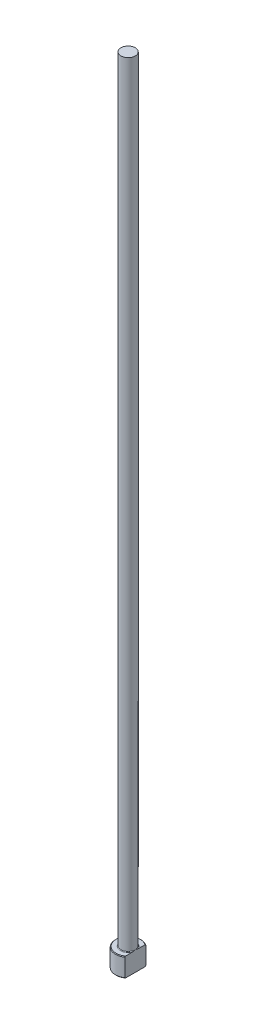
ISO-10303-21;
HEADER;
FILE_DESCRIPTION(('STEP AP214'),'2;1');
FILE_NAME('part.step','',(''),(''),'','','');
FILE_SCHEMA(('AUTOMOTIVE_DESIGN { 1 0 10303 214 1 1 1 1 }'));
ENDSEC;
DATA;
#1=APPLICATION_CONTEXT('core data for automotive mechanical design processes');
#2=APPLICATION_PROTOCOL_DEFINITION('international standard','automotive_design',2000,#1);
#3=PRODUCT_CONTEXT('',#1,'mechanical');
#4=PRODUCT('Part','Part','',(#3));
#5=PRODUCT_RELATED_PRODUCT_CATEGORY('part','',(#4));
#6=PRODUCT_DEFINITION_FORMATION('','',#4);
#7=PRODUCT_DEFINITION_CONTEXT('part definition',#1,'design');
#8=PRODUCT_DEFINITION('design','',#6,#7);
#9=PRODUCT_DEFINITION_SHAPE('','',#8);
#10=(LENGTH_UNIT() NAMED_UNIT(*) SI_UNIT(.MILLI.,.METRE.));
#11=(NAMED_UNIT(*) PLANE_ANGLE_UNIT() SI_UNIT($,.RADIAN.));
#12=(NAMED_UNIT(*) SI_UNIT($,.STERADIAN.) SOLID_ANGLE_UNIT());
#13=UNCERTAINTY_MEASURE_WITH_UNIT(LENGTH_MEASURE(1.E-05),#10,'distance_accuracy_value','');
#14=(GEOMETRIC_REPRESENTATION_CONTEXT(3) GLOBAL_UNCERTAINTY_ASSIGNED_CONTEXT((#13)) GLOBAL_UNIT_ASSIGNED_CONTEXT((#10,
#11,#12)) REPRESENTATION_CONTEXT('',''));
#15=CARTESIAN_POINT('',(0.,0.,0.));
#16=DIRECTION('',(0.,0.,1.));
#17=DIRECTION('',(1.,0.,0.));
#18=AXIS2_PLACEMENT_3D('',#15,#16,#17);
#19=CARTESIAN_POINT('',(0.,0.,0.));
#20=DIRECTION('',(0.,-1.,0.));
#21=DIRECTION('',(0.,0.,-1.));
#22=AXIS2_PLACEMENT_3D('',#19,#20,#21);
#23=PLANE('',#22);
#24=CARTESIAN_POINT('',(0.,0.,0.));
#25=DIRECTION('',(0.,-1.,0.));
#26=DIRECTION('',(0.,0.,-1.));
#27=AXIS2_PLACEMENT_3D('',#24,#25,#26);
#28=CIRCLE('',#27,3.79999999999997);
#29=CARTESIAN_POINT('',(2.24999999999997,0.,3.0622703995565));
#30=VERTEX_POINT('',#29);
#31=CARTESIAN_POINT('',(2.24999999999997,0.,-3.0622703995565));
#32=VERTEX_POINT('',#31);
#33=EDGE_CURVE('E98',#30,#32,#28,.T.);
#34=ORIENTED_EDGE('',*,*,#33,.T.);
#35=DIRECTION('',(0.,0.,1.));
#36=VECTOR('',#35,1.);
#37=CARTESIAN_POINT('',(2.24999999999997,0.,3.30718913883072));
#38=LINE('',#37,#36);
#39=EDGE_CURVE('E83',#32,#30,#38,.T.);
#40=ORIENTED_EDGE('',*,*,#39,.T.);
#41=EDGE_LOOP('',(#34,#40));
#42=FACE_BOUND('',#41,.T.);
#43=ADVANCED_FACE('F32',(#42),#23,.T.);
#44=CARTESIAN_POINT('',(0.,259.958771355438,0.));
#45=DIRECTION('',(0.,1.,0.));
#46=DIRECTION('',(0.,0.,1.));
#47=AXIS2_PLACEMENT_3D('',#44,#45,#46);
#48=CYLINDRICAL_SURFACE('',#47,3.99999999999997);
#49=CARTESIAN_POINT('',(0.,5.79999999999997,0.));
#50=DIRECTION('',(0.,1.,0.));
#51=DIRECTION('',(0.,0.,1.));
#52=AXIS2_PLACEMENT_3D('',#49,#50,#51);
#53=CIRCLE('',#52,3.99999999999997);
#54=CARTESIAN_POINT('',(2.24999999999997,5.79999999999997,3.30718913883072));
#55=VERTEX_POINT('',#54);
#56=CARTESIAN_POINT('',(2.24999999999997,5.79999999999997,-3.30718913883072));
#57=VERTEX_POINT('',#56);
#58=EDGE_CURVE('E104',#55,#57,#53,.F.);
#59=ORIENTED_EDGE('',*,*,#58,.T.);
#60=DIRECTION('',(0.,-1.,0.));
#61=VECTOR('',#60,1.);
#62=CARTESIAN_POINT('',(2.24999999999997,250.,-3.30718913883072));
#63=LINE('',#62,#61);
#64=CARTESIAN_POINT('',(2.24999999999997,0.200000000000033,-3.30718913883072));
#65=VERTEX_POINT('',#64);
#66=EDGE_CURVE('E183',#57,#65,#63,.T.);
#67=ORIENTED_EDGE('',*,*,#66,.T.);
#68=CARTESIAN_POINT('',(0.,0.200000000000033,0.));
#69=DIRECTION('',(0.,-1.,0.));
#70=DIRECTION('',(0.,0.,-1.));
#71=AXIS2_PLACEMENT_3D('',#68,#69,#70);
#72=CIRCLE('',#71,3.99999999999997);
#73=CARTESIAN_POINT('',(2.24999999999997,0.200000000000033,3.30718913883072));
#74=VERTEX_POINT('',#73);
#75=EDGE_CURVE('E100',#65,#74,#72,.F.);
#76=ORIENTED_EDGE('',*,*,#75,.T.);
#77=DIRECTION('',(0.,-1.,0.));
#78=VECTOR('',#77,1.);
#79=CARTESIAN_POINT('',(2.24999999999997,250.,3.30718913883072));
#80=LINE('',#79,#78);
#81=EDGE_CURVE('E93',#55,#74,#80,.T.);
#82=ORIENTED_EDGE('',*,*,#81,.F.);
#83=EDGE_LOOP('',(#59,#67,#76,#82));
#84=FACE_BOUND('',#83,.T.);
#85=ADVANCED_FACE('F158',(#84),#48,.T.);
#86=CARTESIAN_POINT('',(-3.99999999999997,6.,0.));
#87=DIRECTION('',(0.,1.,0.));
#88=DIRECTION('',(0.,0.,1.));
#89=AXIS2_PLACEMENT_3D('',#86,#87,#88);
#90=PLANE('',#89);
#91=CARTESIAN_POINT('',(0.,6.,0.));
#92=DIRECTION('',(0.,1.,0.));
#93=DIRECTION('',(0.,0.,1.));
#94=AXIS2_PLACEMENT_3D('',#91,#92,#93);
#95=CIRCLE('',#94,3.79999999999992);
#96=CARTESIAN_POINT('',(2.24999999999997,6.,-3.06227039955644));
#97=VERTEX_POINT('',#96);
#98=CARTESIAN_POINT('',(2.24999999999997,6.,3.06227039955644));
#99=VERTEX_POINT('',#98);
#100=EDGE_CURVE('E178',#97,#99,#95,.T.);
#101=ORIENTED_EDGE('',*,*,#100,.T.);
#102=DIRECTION('',(0.,0.,-1.));
#103=VECTOR('',#102,1.);
#104=CARTESIAN_POINT('',(2.24999999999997,6.,0.));
#105=LINE('',#104,#103);
#106=CARTESIAN_POINT('',(2.24999999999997,5.99999999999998,0.96953597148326));
#107=VERTEX_POINT('',#106);
#108=EDGE_CURVE('E57',#99,#107,#105,.T.);
#109=ORIENTED_EDGE('',*,*,#108,.T.);
#110=CARTESIAN_POINT('',(0.,6.,0.));
#111=DIRECTION('',(0.,1.,0.));
#112=DIRECTION('',(0.,0.,1.));
#113=AXIS2_PLACEMENT_3D('',#110,#111,#112);
#114=CIRCLE('',#113,2.44999999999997);
#115=CARTESIAN_POINT('',(2.24999999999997,5.99999999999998,-0.969535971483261));
#116=VERTEX_POINT('',#115);
#117=EDGE_CURVE('E107',#107,#116,#114,.F.);
#118=ORIENTED_EDGE('',*,*,#117,.T.);
#119=EDGE_CURVE('E136',#116,#97,#105,.T.);
#120=ORIENTED_EDGE('',*,*,#119,.T.);
#121=EDGE_LOOP('',(#101,#109,#118,#120));
#122=FACE_BOUND('',#121,.T.);
#123=ADVANCED_FACE('F147',(#122),#90,.T.);
#124=CARTESIAN_POINT('',(0.,6.00000000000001,0.));
#125=DIRECTION('',(0.,-1.,0.));
#126=DIRECTION('',(0.,0.,-1.));
#127=AXIS2_PLACEMENT_3D('',#124,#125,#126);
#128=CONICAL_SURFACE('',#127,3.79999999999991,0.785398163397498);
#129=ORIENTED_EDGE('',*,*,#58,.F.);
#130=CARTESIAN_POINT('',(2.24999999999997,2.18230294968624,7.27782992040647));
#131=CARTESIAN_POINT('',(2.24999999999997,2.30866715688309,7.14556140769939));
#132=CARTESIAN_POINT('',(2.24999999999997,2.43487774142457,7.0131459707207));
#133=CARTESIAN_POINT('',(2.24999999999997,2.68692885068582,6.74796170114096));
#134=CARTESIAN_POINT('',(2.24999999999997,2.8127693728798,6.6151928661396));
#135=CARTESIAN_POINT('',(2.24999999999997,3.1897057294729,6.21619905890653));
#136=CARTESIAN_POINT('',(2.24999999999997,3.44014920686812,5.94935693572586));
#137=CARTESIAN_POINT('',(2.24999999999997,3.94026066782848,5.4114698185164));
#138=CARTESIAN_POINT('',(2.24999999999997,4.18991116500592,5.14040850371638));
#139=CARTESIAN_POINT('',(2.24999999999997,4.56140055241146,4.73113683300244));
#140=CARTESIAN_POINT('',(2.24999999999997,4.68472451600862,4.59427552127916));
#141=CARTESIAN_POINT('',(2.24999999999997,4.93009407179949,4.31941326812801));
#142=CARTESIAN_POINT('',(2.24999999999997,5.05213967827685,4.18141233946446));
#143=CARTESIAN_POINT('',(2.24999999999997,5.31419582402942,3.88150807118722));
#144=CARTESIAN_POINT('',(2.24999999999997,5.45391708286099,3.71935099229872));
#145=CARTESIAN_POINT('',(2.24999999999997,5.73025215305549,3.39234412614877));
#146=CARTESIAN_POINT('',(2.24999999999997,5.86686529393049,3.22749377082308));
#147=CARTESIAN_POINT('',(2.24999999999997,6.13534139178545,2.89430849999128));
#148=CARTESIAN_POINT('',(2.24999999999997,6.26721073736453,2.72597879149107));
#149=CARTESIAN_POINT('',(2.24999999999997,6.45966785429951,2.46950762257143));
#150=CARTESIAN_POINT('',(2.24999999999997,6.52291962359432,2.38336821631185));
#151=CARTESIAN_POINT('',(2.24999999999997,6.64714184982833,2.20946418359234));
#152=CARTESIAN_POINT('',(2.24999999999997,6.70811252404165,2.12169971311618));
#153=CARTESIAN_POINT('',(2.24999999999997,6.82102230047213,1.95327886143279));
#154=CARTESIAN_POINT('',(2.24999999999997,6.87324695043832,1.87281476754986));
#155=CARTESIAN_POINT('',(2.24999999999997,6.97467249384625,1.70998172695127));
#156=CARTESIAN_POINT('',(2.24999999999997,7.02387305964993,1.62761257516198));
#157=CARTESIAN_POINT('',(2.24999999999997,7.11837607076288,1.46059799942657));
#158=CARTESIAN_POINT('',(2.24999999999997,7.16367708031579,1.37595175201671));
#159=CARTESIAN_POINT('',(2.24999999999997,7.24914050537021,1.20413766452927));
#160=CARTESIAN_POINT('',(2.24999999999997,7.28930406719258,1.11697039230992));
#161=CARTESIAN_POINT('',(2.24999999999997,7.38314726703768,0.891175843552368));
#162=CARTESIAN_POINT('',(2.24999999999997,7.43219749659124,0.750488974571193));
#163=CARTESIAN_POINT('',(2.24999999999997,7.48826674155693,0.535159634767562));
#164=CARTESIAN_POINT('',(2.24999999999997,7.50402844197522,0.462776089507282));
#165=CARTESIAN_POINT('',(2.24999999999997,7.52893388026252,0.31686046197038));
#166=CARTESIAN_POINT('',(2.24999999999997,7.53807847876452,0.24332853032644));
#167=CARTESIAN_POINT('',(2.24999999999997,7.54922474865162,0.0949504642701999));
#168=CARTESIAN_POINT('',(2.24999999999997,7.5511515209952,0.0200986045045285));
#169=CARTESIAN_POINT('',(2.24999999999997,7.54752076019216,-0.129420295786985));
#170=CARTESIAN_POINT('',(2.24999999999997,7.54196316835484,-0.204087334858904));
#171=CARTESIAN_POINT('',(2.24999999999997,7.52372329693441,-0.35268844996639));
#172=CARTESIAN_POINT('',(2.24999999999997,7.51102617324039,-0.426620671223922));
#173=CARTESIAN_POINT('',(2.24999999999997,7.47926333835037,-0.573094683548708));
#174=CARTESIAN_POINT('',(2.24999999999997,7.46019612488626,-0.645636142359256));
#175=CARTESIAN_POINT('',(2.24999999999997,7.40610994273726,-0.823701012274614));
#176=CARTESIAN_POINT('',(2.24999999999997,7.36783449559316,-0.928230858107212));
#177=CARTESIAN_POINT('',(2.24999999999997,7.28232692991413,-1.1335407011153));
#178=CARTESIAN_POINT('',(2.24999999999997,7.23508812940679,-1.23431783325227));
#179=CARTESIAN_POINT('',(2.24999999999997,7.13380125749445,-1.43298762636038));
#180=CARTESIAN_POINT('',(2.24999999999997,7.0797202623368,-1.53086330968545));
#181=CARTESIAN_POINT('',(2.24999999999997,6.99496203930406,-1.6754864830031));
#182=CARTESIAN_POINT('',(2.24999999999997,6.9661081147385,-1.72332162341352));
#183=CARTESIAN_POINT('',(2.24999999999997,6.90734436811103,-1.81833709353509));
#184=CARTESIAN_POINT('',(2.24999999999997,6.87743458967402,-1.86551745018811));
#185=CARTESIAN_POINT('',(2.24999999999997,6.77509597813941,-2.0235462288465));
#186=CARTESIAN_POINT('',(2.24999999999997,6.70057106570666,-2.13303820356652));
#187=CARTESIAN_POINT('',(2.24999999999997,6.54784662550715,-2.34943854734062));
#188=CARTESIAN_POINT('',(2.24999999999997,6.46964624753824,-2.45634630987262));
#189=CARTESIAN_POINT('',(2.24999999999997,6.31046802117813,-2.66818697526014));
#190=CARTESIAN_POINT('',(2.24999999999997,6.22948822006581,-2.77311840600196));
#191=CARTESIAN_POINT('',(2.24999999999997,6.06545223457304,-2.98134898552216));
#192=CARTESIAN_POINT('',(2.24999999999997,5.98239592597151,-3.08464803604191));
#193=CARTESIAN_POINT('',(2.24999999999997,5.73044258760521,-3.39308007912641));
#194=CARTESIAN_POINT('',(2.24999999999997,5.55914389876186,-3.59624854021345));
#195=CARTESIAN_POINT('',(2.24999999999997,5.2126042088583,-3.99901521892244));
#196=CARTESIAN_POINT('',(2.24999999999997,5.03736490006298,-4.1986149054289));
#197=CARTESIAN_POINT('',(2.24999999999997,4.68403823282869,-4.59551245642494));
#198=CARTESIAN_POINT('',(2.24999999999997,4.50594904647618,-4.79280869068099));
#199=CARTESIAN_POINT('',(2.24999999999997,4.14782580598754,-5.18566037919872));
#200=CARTESIAN_POINT('',(2.24999999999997,3.96779155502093,-5.38121565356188));
#201=CARTESIAN_POINT('',(2.24999999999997,3.60651922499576,-5.77078870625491));
#202=CARTESIAN_POINT('',(2.24999999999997,3.42528278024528,-5.96480800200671));
#203=CARTESIAN_POINT('',(2.24999999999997,3.06174631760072,-6.35184762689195));
#204=CARTESIAN_POINT('',(2.24999999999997,2.8794462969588,-6.54486795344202));
#205=CARTESIAN_POINT('',(2.24999999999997,2.61112326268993,-6.82775668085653));
#206=CARTESIAN_POINT('',(2.24999999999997,2.52542128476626,-6.91792994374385));
#207=CARTESIAN_POINT('',(2.24999999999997,2.35393773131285,-7.09803491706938));
#208=CARTESIAN_POINT('',(2.24999999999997,2.26815631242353,-7.18796677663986));
#209=CARTESIAN_POINT('',(2.24999999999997,2.18230294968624,-7.27782992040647));
#210=B_SPLINE_CURVE_WITH_KNOTS('',3,(#130,#131,#132,#133,#134,#135,#136,#137,#138,#139,#140,
#141,#142,#143,#144,#145,#146,#147,#148,#149,#150,#151,#152,#153,#154,#155,#156,#157,#158,#159,
#160,#161,#162,#163,#164,#165,#166,#167,#168,#169,#170,#171,#172,#173,#174,#175,#176,#177,#178,
#179,#180,#181,#182,#183,#184,#185,#186,#187,#188,#189,#190,#191,#192,#193,#194,#195,#196,#197,
#198,#199,#200,#201,#202,#203,#204,#205,#206,#207,#208,#209),.UNSPECIFIED.,.F.,.F.,(4,2,2,2,2,2,
2,2,2,2,2,2,2,2,2,2,2,2,2,2,2,2,2,2,2,2,2,2,2,2,2,2,2,2,2,2,2,2,2,4),(0.,0.548785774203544,
1.09757528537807,2.19544562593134,3.30094607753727,3.853622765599,4.40629327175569,
5.04841012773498,5.69066421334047,6.33201824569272,6.65259523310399,6.97314160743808,
7.26086761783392,7.54862474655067,7.8364873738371,8.12428565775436,8.56956070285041,
8.79154735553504,9.01350513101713,9.23775987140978,9.46201637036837,9.68674086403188,
9.91151839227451,10.2448678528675,10.5784668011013,10.9137368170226,11.0813178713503,
11.2488920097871,11.6461164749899,12.0434332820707,12.4410351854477,12.8386609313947,
13.6357991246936,14.4326012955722,15.2299368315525,16.0273538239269,16.8238479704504,
17.6203441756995,17.9935523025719,18.3664002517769),.UNSPECIFIED.);
#211=EDGE_CURVE('E135',#55,#99,#210,.T.);
#212=ORIENTED_EDGE('',*,*,#211,.T.);
#213=ORIENTED_EDGE('',*,*,#100,.F.);
#214=EDGE_CURVE('E127',#97,#57,#210,.T.);
#215=ORIENTED_EDGE('',*,*,#214,.T.);
#216=EDGE_LOOP('',(#129,#212,#213,#215));
#217=FACE_BOUND('',#216,.T.);
#218=ADVANCED_FACE('F143',(#217),#128,.T.);
#219=CARTESIAN_POINT('',(0.,0.200000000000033,0.));
#220=DIRECTION('',(0.,1.,0.));
#221=DIRECTION('',(0.,0.,1.));
#222=AXIS2_PLACEMENT_3D('',#219,#220,#221);
#223=CONICAL_SURFACE('',#222,3.99999999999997,0.785398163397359);
#224=ORIENTED_EDGE('',*,*,#75,.F.);
#225=CARTESIAN_POINT('',(2.24999999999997,3.81769705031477,-7.27782992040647));
#226=CARTESIAN_POINT('',(2.24999999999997,3.69133284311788,-7.14556140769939));
#227=CARTESIAN_POINT('',(2.24999999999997,3.56512225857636,-7.01314597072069));
#228=CARTESIAN_POINT('',(2.24999999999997,3.31307114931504,-6.74796170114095));
#229=CARTESIAN_POINT('',(2.24999999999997,3.18723062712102,-6.61519286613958));
#230=CARTESIAN_POINT('',(2.24999999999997,2.81029427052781,-6.21619905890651));
#231=CARTESIAN_POINT('',(2.24999999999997,2.55985079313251,-5.94935693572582));
#232=CARTESIAN_POINT('',(2.24999999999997,2.059739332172,-5.41146981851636));
#233=CARTESIAN_POINT('',(2.24999999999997,1.81008883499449,-5.14040850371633));
#234=CARTESIAN_POINT('',(2.24999999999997,1.43859944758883,-4.73113683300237));
#235=CARTESIAN_POINT('',(2.24999999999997,1.31527548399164,-4.59427552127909));
#236=CARTESIAN_POINT('',(2.24999999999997,1.0699059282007,-4.31941326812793));
#237=CARTESIAN_POINT('',(2.24999999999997,0.94786032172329,-4.18141233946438));
#238=CARTESIAN_POINT('',(2.24999999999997,0.685804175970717,-3.88150807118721));
#239=CARTESIAN_POINT('',(2.24999999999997,0.546082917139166,-3.71935099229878));
#240=CARTESIAN_POINT('',(2.24999999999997,0.269747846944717,-3.39234412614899));
#241=CARTESIAN_POINT('',(2.24999999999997,0.133134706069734,-3.22749377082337));
#242=CARTESIAN_POINT('',(2.24999999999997,-0.135341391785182,-2.89430849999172));
#243=CARTESIAN_POINT('',(2.24999999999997,-0.267210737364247,-2.72597879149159));
#244=CARTESIAN_POINT('',(2.24999999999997,-0.459667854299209,-2.46950762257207));
#245=CARTESIAN_POINT('',(2.24999999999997,-0.52291962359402,-2.38336821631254));
#246=CARTESIAN_POINT('',(2.24999999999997,-0.647141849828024,-2.20946418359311));
#247=CARTESIAN_POINT('',(2.24999999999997,-0.70811252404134,-2.12169971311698));
#248=CARTESIAN_POINT('',(2.24999999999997,-0.82102230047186,-1.95327886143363));
#249=CARTESIAN_POINT('',(2.24999999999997,-0.873246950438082,-1.87281476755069));
#250=CARTESIAN_POINT('',(2.24999999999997,-0.974672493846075,-1.70998172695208));
#251=CARTESIAN_POINT('',(2.24999999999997,-1.02387305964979,-1.62761257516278));
#252=CARTESIAN_POINT('',(2.24999999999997,-1.11837607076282,-1.46059799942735));
#253=CARTESIAN_POINT('',(2.24999999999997,-1.16367708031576,-1.37595175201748));
#254=CARTESIAN_POINT('',(2.24999999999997,-1.24914050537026,-1.20413766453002));
#255=CARTESIAN_POINT('',(2.24999999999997,-1.28930406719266,-1.11697039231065));
#256=CARTESIAN_POINT('',(2.24999999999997,-1.38314726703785,-0.891175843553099));
#257=CARTESIAN_POINT('',(2.24999999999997,-1.43219749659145,-0.750488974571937));
#258=CARTESIAN_POINT('',(2.24999999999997,-1.48826674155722,-0.53515963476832));
#259=CARTESIAN_POINT('',(2.24999999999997,-1.50402844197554,-0.462776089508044));
#260=CARTESIAN_POINT('',(2.24999999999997,-1.52893388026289,-0.316860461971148));
#261=CARTESIAN_POINT('',(2.24999999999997,-1.53807847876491,-0.243328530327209));
#262=CARTESIAN_POINT('',(2.24999999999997,-1.54922474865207,-0.0949504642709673));
#263=CARTESIAN_POINT('',(2.24999999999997,-1.55115152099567,-0.0200986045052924));
#264=CARTESIAN_POINT('',(2.24999999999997,-1.54752076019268,0.12942029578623));
#265=CARTESIAN_POINT('',(2.24999999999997,-1.54196316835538,0.204087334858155));
#266=CARTESIAN_POINT('',(2.24999999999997,-1.523723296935,0.352688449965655));
#267=CARTESIAN_POINT('',(2.24999999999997,-1.511026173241,0.426620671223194));
#268=CARTESIAN_POINT('',(2.24999999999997,-1.47926333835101,0.573094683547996));
#269=CARTESIAN_POINT('',(2.24999999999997,-1.46019612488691,0.645636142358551));
#270=CARTESIAN_POINT('',(2.24999999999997,-1.40610994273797,0.823701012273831));
#271=CARTESIAN_POINT('',(2.24999999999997,-1.36783449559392,0.928230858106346));
#272=CARTESIAN_POINT('',(2.24999999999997,-1.282326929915,1.13354070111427));
#273=CARTESIAN_POINT('',(2.24999999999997,-1.23508812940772,1.23431783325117));
#274=CARTESIAN_POINT('',(2.24999999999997,-1.13380125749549,1.43298762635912));
#275=CARTESIAN_POINT('',(2.24999999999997,-1.0797202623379,1.53086330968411));
#276=CARTESIAN_POINT('',(2.24999999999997,-0.994962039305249,1.67548648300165));
#277=CARTESIAN_POINT('',(2.24999999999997,-0.966108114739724,1.72332162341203));
#278=CARTESIAN_POINT('',(2.24999999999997,-0.907344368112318,1.81833709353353));
#279=CARTESIAN_POINT('',(2.24999999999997,-0.877434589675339,1.8655174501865));
#280=CARTESIAN_POINT('',(2.24999999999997,-0.775095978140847,2.02354622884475));
#281=CARTESIAN_POINT('',(2.24999999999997,-0.700571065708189,2.13303820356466));
#282=CARTESIAN_POINT('',(2.24999999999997,-0.547846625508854,2.34943854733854));
#283=CARTESIAN_POINT('',(2.24999999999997,-0.469646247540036,2.45634630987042));
#284=CARTESIAN_POINT('',(2.24999999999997,-0.310468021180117,2.66818697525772));
#285=CARTESIAN_POINT('',(2.24999999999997,-0.229488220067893,2.77311840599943));
#286=CARTESIAN_POINT('',(2.24999999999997,-0.0654522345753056,2.98134898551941));
#287=CARTESIAN_POINT('',(2.24999999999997,0.0176040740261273,3.08464803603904));
#288=CARTESIAN_POINT('',(2.24999999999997,0.269557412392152,3.39308007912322));
#289=CARTESIAN_POINT('',(2.24999999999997,0.440856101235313,3.59624854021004));
#290=CARTESIAN_POINT('',(2.24999999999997,0.787395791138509,3.99901521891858));
#291=CARTESIAN_POINT('',(2.24999999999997,0.962635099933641,4.19861490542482));
#292=CARTESIAN_POINT('',(2.24999999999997,1.31596176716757,4.59551245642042));
#293=CARTESIAN_POINT('',(2.24999999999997,1.49405095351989,4.79280869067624));
#294=CARTESIAN_POINT('',(2.24999999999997,1.85217419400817,5.18566037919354));
#295=CARTESIAN_POINT('',(2.24999999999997,2.03220844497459,5.38121565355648));
#296=CARTESIAN_POINT('',(2.24999999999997,2.3934807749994,5.77078870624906));
#297=CARTESIAN_POINT('',(2.24999999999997,2.5747172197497,5.96480800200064));
#298=CARTESIAN_POINT('',(2.24999999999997,2.9382536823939,6.35184762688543));
#299=CARTESIAN_POINT('',(2.24999999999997,3.12055370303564,6.54486795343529));
#300=CARTESIAN_POINT('',(2.24999999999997,3.38887673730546,6.82775668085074));
#301=CARTESIAN_POINT('',(2.24999999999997,3.47457871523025,6.91792994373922));
#302=CARTESIAN_POINT('',(2.24999999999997,3.6460622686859,7.09803491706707));
#303=CARTESIAN_POINT('',(2.24999999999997,3.73184368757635,7.1879667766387));
#304=CARTESIAN_POINT('',(2.24999999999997,3.81769705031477,7.27782992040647));
#305=B_SPLINE_CURVE_WITH_KNOTS('',3,(#225,#226,#227,#228,#229,#230,#231,#232,#233,#234,#235,
#236,#237,#238,#239,#240,#241,#242,#243,#244,#245,#246,#247,#248,#249,#250,#251,#252,#253,#254,
#255,#256,#257,#258,#259,#260,#261,#262,#263,#264,#265,#266,#267,#268,#269,#270,#271,#272,#273,
#274,#275,#276,#277,#278,#279,#280,#281,#282,#283,#284,#285,#286,#287,#288,#289,#290,#291,#292,
#293,#294,#295,#296,#297,#298,#299,#300,#301,#302,#303,#304),.UNSPECIFIED.,.F.,.F.,(4,2,2,2,2,2,
2,2,2,2,2,2,2,2,2,2,2,2,2,2,2,2,2,2,2,2,2,2,2,2,2,2,2,2,2,2,2,2,2,4),(0.,0.54878577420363,
1.09757528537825,2.19544562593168,3.30094607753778,3.85362276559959,4.40629327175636,
5.04841012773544,5.69066421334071,6.33201824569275,6.65259523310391,6.97314160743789,
7.26086761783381,7.54862474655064,7.83648737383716,8.12428565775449,8.56956070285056,
8.7915473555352,9.01350513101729,9.23775987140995,9.46201637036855,9.68674086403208,
9.91151839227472,10.2448678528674,10.5784668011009,10.9137368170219,11.0813178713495,
11.2488920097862,11.6461164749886,12.0434332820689,12.4410351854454,12.838660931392,
13.63579912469,14.4326012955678,15.2299368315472,16.0273538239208,16.8238479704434,
17.6203441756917,17.993552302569,18.3664002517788),.UNSPECIFIED.);
#306=EDGE_CURVE('E86',#65,#32,#305,.T.);
#307=ORIENTED_EDGE('',*,*,#306,.T.);
#308=ORIENTED_EDGE('',*,*,#33,.F.);
#309=EDGE_CURVE('E89',#30,#74,#305,.T.);
#310=ORIENTED_EDGE('',*,*,#309,.T.);
#311=EDGE_LOOP('',(#224,#307,#308,#310));
#312=FACE_BOUND('',#311,.T.);
#313=ADVANCED_FACE('F97',(#312),#223,.T.);
#314=CARTESIAN_POINT('',(0.,6.19999999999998,0.));
#315=DIRECTION('',(0.,1.,0.));
#316=DIRECTION('',(0.,0.,1.));
#317=AXIS2_PLACEMENT_3D('',#314,#315,#316);
#318=TOROIDAL_SURFACE('',#317,2.44999999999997,0.2);
#319=CARTESIAN_POINT('',(2.24999999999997,6.19999999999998,0.));
#320=CARTESIAN_POINT('',(2.24999999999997,6.2000005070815,6.44724382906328E-11));
#321=CARTESIAN_POINT('',(2.24999999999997,6.20000101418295,-1.58891197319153E-07));
#322=CARTESIAN_POINT('',(2.24999999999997,6.20000197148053,-6.21779259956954E-07));
#323=CARTESIAN_POINT('',(2.24999999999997,6.20000241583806,-9.34460784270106E-07));
#324=CARTESIAN_POINT('',(2.24999999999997,6.20000332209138,-1.68105194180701E-06));
#325=CARTESIAN_POINT('',(2.24999999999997,6.20000377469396,-2.12646377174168E-06));
#326=CARTESIAN_POINT('',(2.24999999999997,6.20000460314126,-3.06333881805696E-06));
#327=CARTESIAN_POINT('',(2.24999999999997,6.20000498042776,-3.55360522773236E-06));
#328=CARTESIAN_POINT('',(2.24999999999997,6.20000633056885,-5.39956017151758E-06));
#329=CARTESIAN_POINT('',(2.24999999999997,6.20000722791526,-6.81237630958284E-06));
#330=CARTESIAN_POINT('',(2.24999999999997,6.20000875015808,-9.6531589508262E-06));
#331=CARTESIAN_POINT('',(2.24999999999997,6.20000938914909,-1.10739428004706E-05));
#332=CARTESIAN_POINT('',(2.24999999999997,6.20001197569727,-1.69289388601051E-05));
#333=CARTESIAN_POINT('',(2.24999999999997,6.20001384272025,-2.14029810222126E-05));
#334=CARTESIAN_POINT('',(2.24999999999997,6.20001668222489,-2.99701702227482E-05));
#335=CARTESIAN_POINT('',(2.24999999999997,6.20001774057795,-3.40349909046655E-05));
#336=CARTESIAN_POINT('',(2.24999999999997,6.20002529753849,-6.37611263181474E-05));
#337=CARTESIAN_POINT('',(2.24999999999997,6.20003087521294,-8.9609529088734E-05));
#338=CARTESIAN_POINT('',(2.24999999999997,6.20005527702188,-0.000191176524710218));
#339=CARTESIAN_POINT('',(2.24999999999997,6.20007870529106,-0.000265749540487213));
#340=CARTESIAN_POINT('',(2.24999999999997,6.2001693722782,-0.00055979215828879));
#341=CARTESIAN_POINT('',(2.24999999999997,6.20023350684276,-0.000779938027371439));
#342=CARTESIAN_POINT('',(2.24999999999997,6.20048920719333,-0.00165050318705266));
#343=CARTESIAN_POINT('',(2.24999999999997,6.20068459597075,-0.00230007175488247));
#344=CARTESIAN_POINT('',(2.24999999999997,6.20149322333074,-0.00499620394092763));
#345=CARTESIAN_POINT('',(2.24999999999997,6.2021017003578,-0.00704382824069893));
#346=CARTESIAN_POINT('',(2.24999999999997,6.20797104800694,-0.0267853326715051));
#347=CARTESIAN_POINT('',(2.24999999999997,6.21325284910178,-0.0444747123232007));
#348=CARTESIAN_POINT('',(2.24999999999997,6.22356918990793,-0.0791736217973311));
#349=CARTESIAN_POINT('',(2.24999999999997,6.22860532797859,-0.0961827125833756));
#350=CARTESIAN_POINT('',(2.24999999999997,6.23925368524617,-0.132326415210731));
#351=CARTESIAN_POINT('',(2.24999999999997,6.24485983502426,-0.151462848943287));
#352=CARTESIAN_POINT('',(2.24999999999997,6.25603662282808,-0.18996857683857));
#353=CARTESIAN_POINT('',(2.24999999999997,6.26160623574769,-0.209338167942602));
#354=CARTESIAN_POINT('',(2.24999999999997,6.27500311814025,-0.256523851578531));
#355=CARTESIAN_POINT('',(2.24999999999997,6.28276182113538,-0.284359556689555));
#356=CARTESIAN_POINT('',(2.24999999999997,6.29771346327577,-0.33942534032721));
#357=CARTESIAN_POINT('',(2.24999999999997,6.3049157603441,-0.366652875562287));
#358=CARTESIAN_POINT('',(2.24999999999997,6.32240345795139,-0.435090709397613));
#359=CARTESIAN_POINT('',(2.24999999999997,6.33239618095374,-0.476377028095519));
#360=CARTESIAN_POINT('',(2.24999999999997,6.35100390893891,-0.559624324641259));
#361=CARTESIAN_POINT('',(2.24999999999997,6.3596067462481,-0.60158805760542));
#362=CARTESIAN_POINT('',(2.24999999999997,6.37543235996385,-0.689258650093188));
#363=CARTESIAN_POINT('',(2.24999999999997,6.38248971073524,-0.734996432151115));
#364=CARTESIAN_POINT('',(2.24999999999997,6.39342529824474,-0.826730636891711));
#365=CARTESIAN_POINT('',(2.24999999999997,6.39731270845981,-0.872725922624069));
#366=CARTESIAN_POINT('',(2.24999999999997,6.40071499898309,-0.963783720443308));
#367=CARTESIAN_POINT('',(2.24999999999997,6.40033773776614,-1.00884048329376));
#368=CARTESIAN_POINT('',(2.24999999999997,6.39535803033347,-1.07577565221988));
#369=CARTESIAN_POINT('',(2.24999999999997,6.39299580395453,-1.09781842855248));
#370=CARTESIAN_POINT('',(2.24999999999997,6.38649339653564,-1.1416310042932));
#371=CARTESIAN_POINT('',(2.24999999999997,6.38235512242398,-1.16340107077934));
#372=CARTESIAN_POINT('',(2.24999999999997,6.37178290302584,-1.20664751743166));
#373=CARTESIAN_POINT('',(2.24999999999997,6.36532376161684,-1.22811787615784));
#374=CARTESIAN_POINT('',(2.24999999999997,6.34940253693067,-1.26994619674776));
#375=CARTESIAN_POINT('',(2.24999999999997,6.33994859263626,-1.29030700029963));
#376=CARTESIAN_POINT('',(2.24999999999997,6.32341167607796,-1.31784149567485));
#377=CARTESIAN_POINT('',(2.24999999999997,6.31797729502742,-1.3260012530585));
#378=CARTESIAN_POINT('',(2.24999999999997,6.30618383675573,-1.34165219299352));
#379=CARTESIAN_POINT('',(2.24999999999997,6.29982370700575,-1.34914259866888));
#380=CARTESIAN_POINT('',(2.24999999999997,6.28597385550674,-1.36322511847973));
#381=CARTESIAN_POINT('',(2.24999999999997,6.27846961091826,-1.36980324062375));
#382=CARTESIAN_POINT('',(2.24999999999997,6.26235014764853,-1.38141777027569));
#383=CARTESIAN_POINT('',(2.24999999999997,6.25373945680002,-1.38646019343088));
#384=CARTESIAN_POINT('',(2.24999999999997,6.23893119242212,-1.39291408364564));
#385=CARTESIAN_POINT('',(2.24999999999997,6.23301804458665,-1.39497873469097));
#386=CARTESIAN_POINT('',(2.24999999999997,6.22092968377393,-1.3980973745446));
#387=CARTESIAN_POINT('',(2.24999999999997,6.21475469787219,-1.39915222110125));
#388=CARTESIAN_POINT('',(2.24999999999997,6.20229305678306,-1.4001597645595));
#389=CARTESIAN_POINT('',(2.24999999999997,6.19600609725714,-1.40010876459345));
#390=CARTESIAN_POINT('',(2.24999999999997,6.18353929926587,-1.39890051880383));
#391=CARTESIAN_POINT('',(2.24999999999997,6.17735949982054,-1.39774287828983));
#392=CARTESIAN_POINT('',(2.24999999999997,6.16550896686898,-1.39448677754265));
#393=CARTESIAN_POINT('',(2.24999999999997,6.15982782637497,-1.39242539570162));
#394=CARTESIAN_POINT('',(2.24999999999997,6.14882191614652,-1.38751374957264));
#395=CARTESIAN_POINT('',(2.24999999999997,6.14349727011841,-1.38466321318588));
#396=CARTESIAN_POINT('',(2.24999999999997,6.13026923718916,-1.37647479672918));
#397=CARTESIAN_POINT('',(2.24999999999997,6.12266499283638,-1.37065399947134));
#398=CARTESIAN_POINT('',(2.24999999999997,6.10845647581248,-1.35789458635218));
#399=CARTESIAN_POINT('',(2.24999999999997,6.10185542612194,-1.3509525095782));
#400=CARTESIAN_POINT('',(2.24999999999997,6.0855320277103,-1.33150080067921));
#401=CARTESIAN_POINT('',(2.24999999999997,6.07660573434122,-1.31832816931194));
#402=CARTESIAN_POINT('',(2.24999999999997,6.06078136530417,-1.29086374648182));
#403=CARTESIAN_POINT('',(2.24999999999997,6.05388481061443,-1.27657112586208));
#404=CARTESIAN_POINT('',(2.24999999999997,6.03602738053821,-1.23377116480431));
#405=CARTESIAN_POINT('',(2.24999999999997,6.02722778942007,-1.20437236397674));
#406=CARTESIAN_POINT('',(2.24999999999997,6.01362163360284,-1.14441037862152));
#407=CARTESIAN_POINT('',(2.24999999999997,6.00886464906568,-1.11383741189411));
#408=CARTESIAN_POINT('',(2.24999999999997,6.00105881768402,-1.03966563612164));
#409=CARTESIAN_POINT('',(2.24999999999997,5.99953171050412,-0.995912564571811));
#410=CARTESIAN_POINT('',(2.24999999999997,6.00070174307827,-0.9083672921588));
#411=CARTESIAN_POINT('',(2.24999999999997,6.00341475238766,-0.864575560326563));
#412=CARTESIAN_POINT('',(2.24999999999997,6.01171554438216,-0.779778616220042));
#413=CARTESIAN_POINT('',(2.24999999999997,6.01713219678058,-0.73875579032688));
#414=CARTESIAN_POINT('',(2.24999999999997,6.0300163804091,-0.657360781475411));
#415=CARTESIAN_POINT('',(2.24999999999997,6.03746816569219,-0.616986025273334));
#416=CARTESIAN_POINT('',(2.24999999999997,6.0540572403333,-0.53598173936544));
#417=CARTESIAN_POINT('',(2.24999999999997,6.0632173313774,-0.495356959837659));
#418=CARTESIAN_POINT('',(2.24999999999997,6.08297396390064,-0.413374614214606));
#419=CARTESIAN_POINT('',(2.24999999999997,6.09360096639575,-0.372024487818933));
#420=CARTESIAN_POINT('',(2.24999999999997,6.11230155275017,-0.302306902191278));
#421=CARTESIAN_POINT('',(2.24999999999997,6.12014883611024,-0.273877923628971));
#422=CARTESIAN_POINT('',(2.24999999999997,6.1360590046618,-0.217411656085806));
#423=CARTESIAN_POINT('',(2.24999999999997,6.14411864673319,-0.189373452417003));
#424=CARTESIAN_POINT('',(2.24999999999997,6.15951571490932,-0.136466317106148));
#425=CARTESIAN_POINT('',(2.24999999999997,6.16683378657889,-0.111591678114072));
#426=CARTESIAN_POINT('',(2.24999999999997,6.18187191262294,-0.0608432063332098));
#427=CARTESIAN_POINT('',(2.24999999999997,6.18959608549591,-0.0349705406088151));
#428=CARTESIAN_POINT('',(2.24999999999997,6.19789887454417,-0.00704171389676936));
#429=CARTESIAN_POINT('',(2.24999999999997,6.19850801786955,-0.00499199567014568));
#430=CARTESIAN_POINT('',(2.24999999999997,6.19931680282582,-0.00229537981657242));
#431=CARTESIAN_POINT('',(2.24999999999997,6.19951170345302,-0.00164742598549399));
#432=CARTESIAN_POINT('',(2.24999999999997,6.19976680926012,-0.000778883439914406));
#433=CARTESIAN_POINT('',(2.24999999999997,6.19983082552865,-0.000559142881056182));
#434=CARTESIAN_POINT('',(2.24999999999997,6.19992134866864,-0.000265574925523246));
#435=CARTESIAN_POINT('',(2.24999999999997,6.19994475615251,-0.000191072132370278));
#436=CARTESIAN_POINT('',(2.24999999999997,6.1999691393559,-8.95867312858E-05));
#437=CARTESIAN_POINT('',(2.24999999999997,6.19997471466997,-6.37485909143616E-05));
#438=CARTESIAN_POINT('',(2.24999999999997,6.19998226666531,-3.40328344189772E-05));
#439=CARTESIAN_POINT('',(2.24999999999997,6.19998332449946,-2.99686231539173E-05));
#440=CARTESIAN_POINT('',(2.24999999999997,6.19998616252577,-2.1402647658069E-05));
#441=CARTESIAN_POINT('',(2.24999999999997,6.19998802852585,-1.69291780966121E-05));
#442=CARTESIAN_POINT('',(2.24999999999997,6.19999061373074,-1.10747628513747E-05));
#443=CARTESIAN_POINT('',(2.24999999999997,6.19999125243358,-9.65402457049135E-06));
#444=CARTESIAN_POINT('',(2.24999999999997,6.19999277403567,-6.81328226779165E-06));
#445=CARTESIAN_POINT('',(2.24999999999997,6.19999367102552,-5.40045593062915E-06));
#446=CARTESIAN_POINT('',(2.24999999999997,6.19999502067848,-3.55442707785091E-06));
#447=CARTESIAN_POINT('',(2.24999999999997,6.19999539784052,-3.06412589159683E-06));
#448=CARTESIAN_POINT('',(2.24999999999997,6.19999622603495,-2.12715884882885E-06));
#449=CARTESIAN_POINT('',(2.24999999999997,6.19999667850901,-1.68168921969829E-06));
#450=CARTESIAN_POINT('',(2.24999999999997,6.19999758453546,-9.3496060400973E-07));
#451=CARTESIAN_POINT('',(2.24999999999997,6.19999802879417,-6.22203859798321E-07));
#452=CARTESIAN_POINT('',(2.24999999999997,6.1999989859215,-1.59128814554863E-07));
#453=CARTESIAN_POINT('',(2.24999999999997,6.19999949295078,-6.44683302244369E-11));
#454=CARTESIAN_POINT('',(2.24999999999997,6.19999999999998,0.));
#455=B_SPLINE_CURVE_WITH_KNOTS('',3,(#319,#320,#321,#322,#323,#324,#325,#326,#327,#328,#329,
#330,#331,#332,#333,#334,#335,#336,#337,#338,#339,#340,#341,#342,#343,#344,#345,#346,#347,#348,
#349,#350,#351,#352,#353,#354,#355,#356,#357,#358,#359,#360,#361,#362,#363,#364,#365,#366,#367,
#368,#369,#370,#371,#372,#373,#374,#375,#376,#377,#378,#379,#380,#381,#382,#383,#384,#385,#386,
#387,#388,#389,#390,#391,#392,#393,#394,#395,#396,#397,#398,#399,#400,#401,#402,#403,#404,#405,
#406,#407,#408,#409,#410,#411,#412,#413,#414,#415,#416,#417,#418,#419,#420,#421,#422,#423,#424,
#425,#426,#427,#428,#429,#430,#431,#432,#433,#434,#435,#436,#437,#438,#439,#440,#441,#442,#443,
#444,#445,#446,#447,#448,#449,#450,#451,#452,#453,#454),.UNSPECIFIED.,.T.,.F.,(4,2,2,2,2,2,2,2,
2,2,2,2,2,2,2,2,2,2,2,2,2,2,2,2,2,2,2,2,2,2,2,2,2,2,2,2,2,2,2,2,2,2,2,2,2,2,2,2,2,2,2,2,2,2,2,2,
2,2,2,2,2,2,2,2,2,2,2,4),(0.,1.52660877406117E-06,3.15241312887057E-06,5.04759814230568E-06,
6.90201312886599E-06,1.19024879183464E-05,1.65722252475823E-05,3.10841856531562E-05,
4.36688546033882E-05,0.000123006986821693,0.000357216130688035,0.00104540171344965,
0.00308000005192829,0.00948876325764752,0.0648698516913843,0.118087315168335,0.17790910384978,
0.238372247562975,0.325060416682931,0.409550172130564,0.536965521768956,0.665442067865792,
0.804194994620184,0.942544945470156,1.07740386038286,1.14385780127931,1.21024056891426,
1.2773669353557,1.34431241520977,1.37367425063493,1.40306973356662,1.43287536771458,
1.46256269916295,1.48127715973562,1.49997570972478,1.51873677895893,1.53750454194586,
1.55556541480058,1.57363252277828,1.60219661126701,1.63085061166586,1.67831692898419,
1.72581872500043,1.81736829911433,1.91002510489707,2.04102939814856,2.17252517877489,
2.29658958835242,2.41972004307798,2.54462990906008,2.67269769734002,2.76117244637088,
2.84869182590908,2.9264787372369,3.00747864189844,3.01389398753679,3.01592352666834,
3.01661044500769,3.01684443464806,3.01692374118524,3.0169363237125,3.01695083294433,
3.01695550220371,3.01696050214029,3.01696235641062,3.01696425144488,3.01696587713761,
3.01696740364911),.UNSPECIFIED.);
#456=CARTESIAN_POINT('',(2.24999999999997,6.19999999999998,0.));
#457=VERTEX_POINT('',#456);
#458=EDGE_CURVE('E11',#116,#457,#455,.T.);
#459=ORIENTED_EDGE('',*,*,#458,.F.);
#460=ORIENTED_EDGE('',*,*,#117,.F.);
#461=CARTESIAN_POINT('',(2.24999999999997,6.19999999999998,0.));
#462=CARTESIAN_POINT('',(2.24999999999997,6.19999949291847,-6.4472444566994E-11));
#463=CARTESIAN_POINT('',(2.24999999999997,6.19999898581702,1.58891197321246E-07));
#464=CARTESIAN_POINT('',(2.24999999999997,6.19999802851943,6.2177925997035E-07));
#465=CARTESIAN_POINT('',(2.24999999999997,6.1999975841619,9.3446078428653E-07));
#466=CARTESIAN_POINT('',(2.24999999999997,6.19999667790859,1.68105194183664E-06));
#467=CARTESIAN_POINT('',(2.24999999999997,6.199996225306,2.1264637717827E-06));
#468=CARTESIAN_POINT('',(2.24999999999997,6.19999539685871,3.06333881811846E-06));
#469=CARTESIAN_POINT('',(2.24999999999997,6.1999950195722,3.55360522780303E-06));
#470=CARTESIAN_POINT('',(2.24999999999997,6.19999366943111,5.39956017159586E-06));
#471=CARTESIAN_POINT('',(2.24999999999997,6.19999277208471,6.81237630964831E-06));
#472=CARTESIAN_POINT('',(2.24999999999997,6.19999124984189,9.65315895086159E-06));
#473=CARTESIAN_POINT('',(2.24999999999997,6.19999061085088,1.10739428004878E-05));
#474=CARTESIAN_POINT('',(2.24999999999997,6.19998802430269,1.69289388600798E-05));
#475=CARTESIAN_POINT('',(2.24999999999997,6.19998615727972,2.14029810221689E-05));
#476=CARTESIAN_POINT('',(2.24999999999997,6.19998331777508,2.99701702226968E-05));
#477=CARTESIAN_POINT('',(2.24999999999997,6.19998225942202,3.40349909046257E-05));
#478=CARTESIAN_POINT('',(2.24999999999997,6.19997470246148,6.37611263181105E-05));
#479=CARTESIAN_POINT('',(2.24999999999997,6.19996912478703,8.9609529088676E-05));
#480=CARTESIAN_POINT('',(2.24999999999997,6.19994472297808,0.000191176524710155));
#481=CARTESIAN_POINT('',(2.24999999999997,6.1999212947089,0.000265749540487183));
#482=CARTESIAN_POINT('',(2.24999999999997,6.19983062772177,0.000559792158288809));
#483=CARTESIAN_POINT('',(2.24999999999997,6.1997664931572,0.000779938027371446));
#484=CARTESIAN_POINT('',(2.24999999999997,6.19951079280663,0.00165050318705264));
#485=CARTESIAN_POINT('',(2.24999999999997,6.19931540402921,0.00230007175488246));
#486=CARTESIAN_POINT('',(2.24999999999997,6.19850677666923,0.00499620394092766));
#487=CARTESIAN_POINT('',(2.24999999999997,6.19789829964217,0.00704382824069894));
#488=CARTESIAN_POINT('',(2.24999999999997,6.19202895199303,0.0267853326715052));
#489=CARTESIAN_POINT('',(2.24999999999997,6.18674715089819,0.0444747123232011));
#490=CARTESIAN_POINT('',(2.24999999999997,6.17643081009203,0.0791736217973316));
#491=CARTESIAN_POINT('',(2.24999999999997,6.17139467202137,0.0961827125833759));
#492=CARTESIAN_POINT('',(2.24999999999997,6.1607463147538,0.132326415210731));
#493=CARTESIAN_POINT('',(2.24999999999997,6.15514016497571,0.151462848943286));
#494=CARTESIAN_POINT('',(2.24999999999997,6.14396337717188,0.18996857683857));
#495=CARTESIAN_POINT('',(2.24999999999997,6.13839376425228,0.209338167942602));
#496=CARTESIAN_POINT('',(2.24999999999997,6.12499688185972,0.256523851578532));
#497=CARTESIAN_POINT('',(2.24999999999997,6.11723817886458,0.284359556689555));
#498=CARTESIAN_POINT('',(2.24999999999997,6.10228653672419,0.33942534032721));
#499=CARTESIAN_POINT('',(2.24999999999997,6.09508423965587,0.366652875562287));
#500=CARTESIAN_POINT('',(2.24999999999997,6.07759654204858,0.435090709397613));
#501=CARTESIAN_POINT('',(2.24999999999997,6.06760381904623,0.476377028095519));
#502=CARTESIAN_POINT('',(2.24999999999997,6.04899609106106,0.559624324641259));
#503=CARTESIAN_POINT('',(2.24999999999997,6.04039325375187,0.60158805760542));
#504=CARTESIAN_POINT('',(2.24999999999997,6.02456764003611,0.689258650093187));
#505=CARTESIAN_POINT('',(2.24999999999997,6.01751028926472,0.734996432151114));
#506=CARTESIAN_POINT('',(2.24999999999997,6.00657470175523,0.826730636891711));
#507=CARTESIAN_POINT('',(2.24999999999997,6.00268729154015,0.872725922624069));
#508=CARTESIAN_POINT('',(2.24999999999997,5.99928500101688,0.963783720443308));
#509=CARTESIAN_POINT('',(2.24999999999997,5.99966226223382,1.00884048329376));
#510=CARTESIAN_POINT('',(2.24999999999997,6.0046419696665,1.07577565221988));
#511=CARTESIAN_POINT('',(2.24999999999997,6.00700419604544,1.09781842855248));
#512=CARTESIAN_POINT('',(2.24999999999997,6.01350660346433,1.1416310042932));
#513=CARTESIAN_POINT('',(2.24999999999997,6.01764487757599,1.16340107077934));
#514=CARTESIAN_POINT('',(2.24999999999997,6.02821709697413,1.20664751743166));
#515=CARTESIAN_POINT('',(2.24999999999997,6.03467623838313,1.22811787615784));
#516=CARTESIAN_POINT('',(2.24999999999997,6.0505974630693,1.26994619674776));
#517=CARTESIAN_POINT('',(2.24999999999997,6.0600514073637,1.29030700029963));
#518=CARTESIAN_POINT('',(2.24999999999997,6.07658832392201,1.31784149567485));
#519=CARTESIAN_POINT('',(2.24999999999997,6.08202270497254,1.3260012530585));
#520=CARTESIAN_POINT('',(2.24999999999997,6.09381616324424,1.34165219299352));
#521=CARTESIAN_POINT('',(2.24999999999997,6.10017629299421,1.34914259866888));
#522=CARTESIAN_POINT('',(2.24999999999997,6.11402614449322,1.36322511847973));
#523=CARTESIAN_POINT('',(2.24999999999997,6.12153038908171,1.36980324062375));
#524=CARTESIAN_POINT('',(2.24999999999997,6.13764985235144,1.38141777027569));
#525=CARTESIAN_POINT('',(2.24999999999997,6.14626054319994,1.38646019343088));
#526=CARTESIAN_POINT('',(2.24999999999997,6.16106880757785,1.39291408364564));
#527=CARTESIAN_POINT('',(2.24999999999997,6.16698195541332,1.39497873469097));
#528=CARTESIAN_POINT('',(2.24999999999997,6.17907031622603,1.3980973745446));
#529=CARTESIAN_POINT('',(2.24999999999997,6.18524530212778,1.39915222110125));
#530=CARTESIAN_POINT('',(2.24999999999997,6.1977069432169,1.4001597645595));
#531=CARTESIAN_POINT('',(2.24999999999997,6.20399390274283,1.40010876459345));
#532=CARTESIAN_POINT('',(2.24999999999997,6.21646070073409,1.39890051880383));
#533=CARTESIAN_POINT('',(2.24999999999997,6.22264050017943,1.39774287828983));
#534=CARTESIAN_POINT('',(2.24999999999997,6.23449103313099,1.39448677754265));
#535=CARTESIAN_POINT('',(2.24999999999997,6.240172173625,1.39242539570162));
#536=CARTESIAN_POINT('',(2.24999999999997,6.25117808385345,1.38751374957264));
#537=CARTESIAN_POINT('',(2.24999999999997,6.25650272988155,1.38466321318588));
#538=CARTESIAN_POINT('',(2.24999999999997,6.26973076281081,1.37647479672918));
#539=CARTESIAN_POINT('',(2.24999999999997,6.27733500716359,1.37065399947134));
#540=CARTESIAN_POINT('',(2.24999999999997,6.29154352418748,1.35789458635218));
#541=CARTESIAN_POINT('',(2.24999999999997,6.29814457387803,1.3509525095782));
#542=CARTESIAN_POINT('',(2.24999999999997,6.31446797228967,1.33150080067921));
#543=CARTESIAN_POINT('',(2.24999999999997,6.32339426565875,1.31832816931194));
#544=CARTESIAN_POINT('',(2.24999999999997,6.3392186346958,1.29086374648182));
#545=CARTESIAN_POINT('',(2.24999999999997,6.34611518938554,1.27657112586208));
#546=CARTESIAN_POINT('',(2.24999999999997,6.36397261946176,1.23377116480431));
#547=CARTESIAN_POINT('',(2.24999999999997,6.3727722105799,1.20437236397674));
#548=CARTESIAN_POINT('',(2.24999999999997,6.38637836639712,1.14441037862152));
#549=CARTESIAN_POINT('',(2.24999999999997,6.39113535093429,1.11383741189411));
#550=CARTESIAN_POINT('',(2.24999999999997,6.39894118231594,1.03966563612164));
#551=CARTESIAN_POINT('',(2.24999999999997,6.40046828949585,0.995912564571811));
#552=CARTESIAN_POINT('',(2.24999999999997,6.3992982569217,0.9083672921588));
#553=CARTESIAN_POINT('',(2.24999999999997,6.39658524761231,0.864575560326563));
#554=CARTESIAN_POINT('',(2.24999999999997,6.38828445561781,0.779778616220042));
#555=CARTESIAN_POINT('',(2.24999999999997,6.38286780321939,0.73875579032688));
#556=CARTESIAN_POINT('',(2.24999999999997,6.36998361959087,0.657360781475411));
#557=CARTESIAN_POINT('',(2.24999999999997,6.36253183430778,0.616986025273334));
#558=CARTESIAN_POINT('',(2.24999999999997,6.34594275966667,0.53598173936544));
#559=CARTESIAN_POINT('',(2.24999999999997,6.33678266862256,0.495356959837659));
#560=CARTESIAN_POINT('',(2.24999999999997,6.31702603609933,0.413374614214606));
#561=CARTESIAN_POINT('',(2.24999999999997,6.30639903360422,0.372024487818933));
#562=CARTESIAN_POINT('',(2.24999999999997,6.2876984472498,0.302306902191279));
#563=CARTESIAN_POINT('',(2.24999999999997,6.27985116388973,0.273877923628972));
#564=CARTESIAN_POINT('',(2.24999999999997,6.26394099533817,0.217411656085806));
#565=CARTESIAN_POINT('',(2.24999999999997,6.25588135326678,0.189373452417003));
#566=CARTESIAN_POINT('',(2.24999999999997,6.24048428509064,0.136466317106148));
#567=CARTESIAN_POINT('',(2.24999999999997,6.23316621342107,0.111591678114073));
#568=CARTESIAN_POINT('',(2.24999999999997,6.21812808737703,0.0608432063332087));
#569=CARTESIAN_POINT('',(2.24999999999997,6.21040391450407,0.0349705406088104));
#570=CARTESIAN_POINT('',(2.24999999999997,6.2021011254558,0.00704171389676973));
#571=CARTESIAN_POINT('',(2.24999999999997,6.20149198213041,0.00499199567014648));
#572=CARTESIAN_POINT('',(2.24999999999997,6.20068319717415,0.00229537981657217));
#573=CARTESIAN_POINT('',(2.24999999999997,6.20048829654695,0.00164742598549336));
#574=CARTESIAN_POINT('',(2.24999999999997,6.20023319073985,0.000778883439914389));
#575=CARTESIAN_POINT('',(2.24999999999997,6.20016917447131,0.000559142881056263));
#576=CARTESIAN_POINT('',(2.24999999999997,6.20007865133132,0.000265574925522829));
#577=CARTESIAN_POINT('',(2.24999999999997,6.20005524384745,0.000191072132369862));
#578=CARTESIAN_POINT('',(2.24999999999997,6.20003086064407,8.95867312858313E-05));
#579=CARTESIAN_POINT('',(2.24999999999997,6.20002528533,6.37485909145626E-05));
#580=CARTESIAN_POINT('',(2.24999999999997,6.20001773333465,3.40328344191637E-05));
#581=CARTESIAN_POINT('',(2.24999999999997,6.20001667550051,2.99686231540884E-05));
#582=CARTESIAN_POINT('',(2.24999999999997,6.2000138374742,2.14026476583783E-05));
#583=CARTESIAN_POINT('',(2.24999999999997,6.20001197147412,1.6929178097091E-05));
#584=CARTESIAN_POINT('',(2.24999999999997,6.20000938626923,1.10747628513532E-05));
#585=CARTESIAN_POINT('',(2.24999999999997,6.20000874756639,9.65402457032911E-06));
#586=CARTESIAN_POINT('',(2.24999999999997,6.2000072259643,6.8132822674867E-06));
#587=CARTESIAN_POINT('',(2.24999999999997,6.20000632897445,5.40045593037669E-06));
#588=CARTESIAN_POINT('',(2.24999999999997,6.20000497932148,3.55442707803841E-06));
#589=CARTESIAN_POINT('',(2.24999999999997,6.20000460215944,3.06412589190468E-06));
#590=CARTESIAN_POINT('',(2.24999999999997,6.20000377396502,2.12715884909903E-06));
#591=CARTESIAN_POINT('',(2.24999999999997,6.20000332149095,1.68168921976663E-06));
#592=CARTESIAN_POINT('',(2.24999999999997,6.2000024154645,9.34960603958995E-07));
#593=CARTESIAN_POINT('',(2.24999999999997,6.2000019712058,6.2220385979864E-07));
#594=CARTESIAN_POINT('',(2.24999999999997,6.20000101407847,1.59128814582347E-07));
#595=CARTESIAN_POINT('',(2.24999999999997,6.20000050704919,6.44683365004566E-11));
#596=CARTESIAN_POINT('',(2.24999999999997,6.19999999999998,0.));
#597=B_SPLINE_CURVE_WITH_KNOTS('',3,(#461,#462,#463,#464,#465,#466,#467,#468,#469,#470,#471,
#472,#473,#474,#475,#476,#477,#478,#479,#480,#481,#482,#483,#484,#485,#486,#487,#488,#489,#490,
#491,#492,#493,#494,#495,#496,#497,#498,#499,#500,#501,#502,#503,#504,#505,#506,#507,#508,#509,
#510,#511,#512,#513,#514,#515,#516,#517,#518,#519,#520,#521,#522,#523,#524,#525,#526,#527,#528,
#529,#530,#531,#532,#533,#534,#535,#536,#537,#538,#539,#540,#541,#542,#543,#544,#545,#546,#547,
#548,#549,#550,#551,#552,#553,#554,#555,#556,#557,#558,#559,#560,#561,#562,#563,#564,#565,#566,
#567,#568,#569,#570,#571,#572,#573,#574,#575,#576,#577,#578,#579,#580,#581,#582,#583,#584,#585,
#586,#587,#588,#589,#590,#591,#592,#593,#594,#595,#596),.UNSPECIFIED.,.T.,.F.,(4,2,2,2,2,2,2,2,
2,2,2,2,2,2,2,2,2,2,2,2,2,2,2,2,2,2,2,2,2,2,2,2,2,2,2,2,2,2,2,2,2,2,2,2,2,2,2,2,2,2,2,2,2,2,2,2,
2,2,2,2,2,2,2,2,2,2,2,4),(0.,1.52660877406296E-06,3.1524131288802E-06,5.04759814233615E-06,
6.90201312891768E-06,1.1902487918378E-05,1.65722252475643E-05,3.10841856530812E-05,
4.36688546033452E-05,0.000123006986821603,0.000357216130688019,0.00104540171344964,
0.00308000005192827,0.0094887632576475,0.0648698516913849,0.118087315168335,0.17790910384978,
0.238372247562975,0.325060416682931,0.409550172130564,0.536965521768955,0.665442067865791,
0.804194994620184,0.942544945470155,1.07740386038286,1.14385780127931,1.21024056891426,
1.2773669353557,1.34431241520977,1.37367425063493,1.40306973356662,1.43287536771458,
1.46256269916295,1.48127715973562,1.49997570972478,1.51873677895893,1.53750454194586,
1.55556541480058,1.57363252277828,1.60219661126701,1.63085061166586,1.67831692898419,
1.72581872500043,1.81736829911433,1.91002510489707,2.04102939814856,2.17252517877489,
2.29658958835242,2.41972004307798,2.54462990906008,2.67269769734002,2.76117244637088,
2.84869182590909,2.9264787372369,3.00747864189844,3.01389398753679,3.01592352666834,
3.0166104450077,3.01684443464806,3.01692374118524,3.0169363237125,3.01695083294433,
3.01695550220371,3.01696050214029,3.01696235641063,3.01696425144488,3.01696587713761,
3.01696740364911),.UNSPECIFIED.);
#598=EDGE_CURVE('E46',#457,#107,#597,.T.);
#599=ORIENTED_EDGE('',*,*,#598,.F.);
#600=CARTESIAN_POINT('',(0.,6.19999999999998,0.));
#601=DIRECTION('',(0.,1.,0.));
#602=DIRECTION('',(0.,0.,1.));
#603=AXIS2_PLACEMENT_3D('',#600,#601,#602);
#604=CIRCLE('',#603,2.24999999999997);
#605=EDGE_CURVE('E103',#457,#457,#604,.T.);
#606=ORIENTED_EDGE('',*,*,#605,.F.);
#607=EDGE_LOOP('',(#459,#460,#599,#606));
#608=FACE_BOUND('',#607,.T.);
#609=ADVANCED_FACE('F34',(#608),#318,.F.);
#610=CARTESIAN_POINT('',(0.,259.958771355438,0.));
#611=DIRECTION('',(0.,1.,0.));
#612=DIRECTION('',(0.,0.,1.));
#613=AXIS2_PLACEMENT_3D('',#610,#611,#612);
#614=CYLINDRICAL_SURFACE('',#613,2.24999999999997);
#615=ORIENTED_EDGE('',*,*,#605,.T.);
#616=EDGE_LOOP('',(#615));
#617=FACE_BOUND('',#616,.T.);
#618=CARTESIAN_POINT('',(0.,250.,0.));
#619=DIRECTION('',(0.,1.,0.));
#620=DIRECTION('',(0.,0.,1.));
#621=AXIS2_PLACEMENT_3D('',#618,#619,#620);
#622=CIRCLE('',#621,2.24999999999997);
#623=CARTESIAN_POINT('',(0.,250.,2.24999999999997));
#624=VERTEX_POINT('',#623);
#625=EDGE_CURVE('E101',#624,#624,#622,.T.);
#626=ORIENTED_EDGE('',*,*,#625,.F.);
#627=EDGE_LOOP('',(#626));
#628=FACE_BOUND('',#627,.T.);
#629=ADVANCED_FACE('F155',(#617,#628),#614,.T.);
#630=CARTESIAN_POINT('',(-2.24999999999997,250.,0.));
#631=DIRECTION('',(0.,1.,0.));
#632=DIRECTION('',(0.,0.,1.));
#633=AXIS2_PLACEMENT_3D('',#630,#631,#632);
#634=PLANE('',#633);
#635=ORIENTED_EDGE('',*,*,#625,.T.);
#636=EDGE_LOOP('',(#635));
#637=FACE_BOUND('',#636,.T.);
#638=ADVANCED_FACE('F121',(#637),#634,.T.);
#639=CARTESIAN_POINT('',(2.24999999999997,250.,3.30718913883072));
#640=DIRECTION('',(1.,0.,0.));
#641=DIRECTION('',(0.,0.,-1.));
#642=AXIS2_PLACEMENT_3D('',#639,#640,#641);
#643=PLANE('',#642);
#644=ORIENTED_EDGE('',*,*,#66,.F.);
#645=ORIENTED_EDGE('',*,*,#214,.F.);
#646=ORIENTED_EDGE('',*,*,#119,.F.);
#647=ORIENTED_EDGE('',*,*,#458,.T.);
#648=ORIENTED_EDGE('',*,*,#598,.T.);
#649=ORIENTED_EDGE('',*,*,#108,.F.);
#650=ORIENTED_EDGE('',*,*,#211,.F.);
#651=ORIENTED_EDGE('',*,*,#81,.T.);
#652=ORIENTED_EDGE('',*,*,#309,.F.);
#653=ORIENTED_EDGE('',*,*,#39,.F.);
#654=ORIENTED_EDGE('',*,*,#306,.F.);
#655=EDGE_LOOP('',(#644,#645,#646,#647,#648,#649,#650,#651,#652,#653,#654));
#656=FACE_BOUND('',#655,.T.);
#657=ADVANCED_FACE('F85',(#656),#643,.T.);
#658=CLOSED_SHELL('',(#43,#85,#123,#218,#313,#609,#629,#638,#657));
#659=MANIFOLD_SOLID_BREP('B2',#658);
#660=ADVANCED_BREP_SHAPE_REPRESENTATION('',(#18,#659),#14);
#661=SHAPE_DEFINITION_REPRESENTATION(#9,#660);
ENDSEC;
END-ISO-10303-21;
